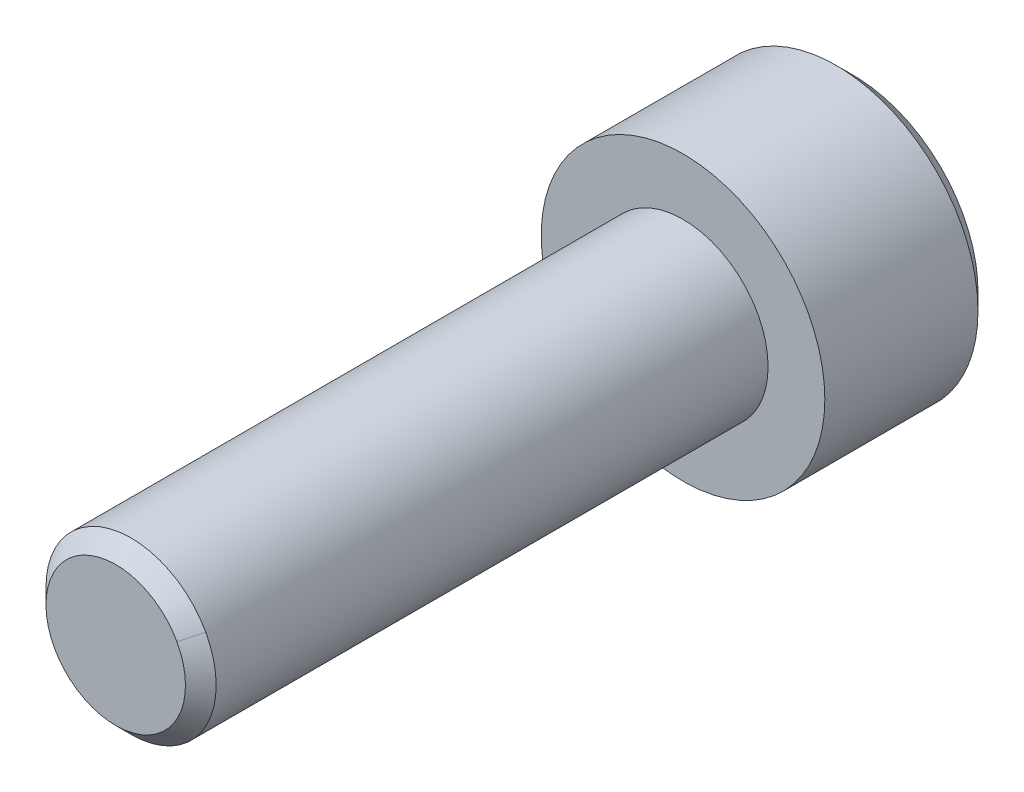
ISO-10303-21;
HEADER;
FILE_DESCRIPTION(('STEP AP214'),'2;1');
FILE_NAME('part.step','',(''),(''),'','','');
FILE_SCHEMA(('AUTOMOTIVE_DESIGN { 1 0 10303 214 1 1 1 1 }'));
ENDSEC;
DATA;
#1=APPLICATION_CONTEXT('core data for automotive mechanical design processes');
#2=APPLICATION_PROTOCOL_DEFINITION('international standard','automotive_design',2000,#1);
#3=PRODUCT_CONTEXT('',#1,'mechanical');
#4=PRODUCT('Part','Part','',(#3));
#5=PRODUCT_RELATED_PRODUCT_CATEGORY('part','',(#4));
#6=PRODUCT_DEFINITION_FORMATION('','',#4);
#7=PRODUCT_DEFINITION_CONTEXT('part definition',#1,'design');
#8=PRODUCT_DEFINITION('design','',#6,#7);
#9=PRODUCT_DEFINITION_SHAPE('','',#8);
#10=(LENGTH_UNIT() NAMED_UNIT(*) SI_UNIT(.MILLI.,.METRE.));
#11=(NAMED_UNIT(*) PLANE_ANGLE_UNIT() SI_UNIT($,.RADIAN.));
#12=(NAMED_UNIT(*) SI_UNIT($,.STERADIAN.) SOLID_ANGLE_UNIT());
#13=UNCERTAINTY_MEASURE_WITH_UNIT(LENGTH_MEASURE(1.E-05),#10,'distance_accuracy_value','');
#14=(GEOMETRIC_REPRESENTATION_CONTEXT(3) GLOBAL_UNCERTAINTY_ASSIGNED_CONTEXT((#13)) GLOBAL_UNIT_ASSIGNED_CONTEXT((#10,
#11,#12)) REPRESENTATION_CONTEXT('',''));
#15=CARTESIAN_POINT('',(0.,0.,0.));
#16=DIRECTION('',(0.,0.,1.));
#17=DIRECTION('',(1.,0.,0.));
#18=AXIS2_PLACEMENT_3D('',#15,#16,#17);
#19=CARTESIAN_POINT('',(0.,0.,3.));
#20=DIRECTION('',(0.,0.,-1.));
#21=DIRECTION('',(-1.,0.,0.));
#22=AXIS2_PLACEMENT_3D('',#19,#20,#21);
#23=PLANE('',#22);
#24=DIRECTION('',(0.50000000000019,-0.866025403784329,0.));
#25=VECTOR('',#24,1.);
#26=CARTESIAN_POINT('',(1.44337567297,2.5,3.));
#27=LINE('',#26,#25);
#28=CARTESIAN_POINT('',(2.88675134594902,-5.68989300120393E-13,3.));
#29=VERTEX_POINT('',#28);
#30=CARTESIAN_POINT('',(1.44337567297,2.5,3.));
#31=VERTEX_POINT('',#30);
#32=EDGE_CURVE('E98',#29,#31,#27,.F.);
#33=ORIENTED_EDGE('',*,*,#32,.F.);
#34=DIRECTION('',(-0.50000000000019,-0.866025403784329,0.));
#35=VECTOR('',#34,1.);
#36=CARTESIAN_POINT('',(2.88675134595,0.,3.));
#37=LINE('',#36,#35);
#38=CARTESIAN_POINT('',(1.44337567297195,-2.50000000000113,3.));
#39=VERTEX_POINT('',#38);
#40=EDGE_CURVE('E79',#39,#29,#37,.F.);
#41=ORIENTED_EDGE('',*,*,#40,.F.);
#42=DIRECTION('',(-1.,0.,0.));
#43=VECTOR('',#42,1.);
#44=CARTESIAN_POINT('',(1.44337567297,-2.50000000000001,3.));
#45=LINE('',#44,#43);
#46=CARTESIAN_POINT('',(-1.44337567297,-2.5,3.));
#47=VERTEX_POINT('',#46);
#48=EDGE_CURVE('E95',#47,#39,#45,.F.);
#49=ORIENTED_EDGE('',*,*,#48,.F.);
#50=DIRECTION('',(-0.50000000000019,0.866025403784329,0.));
#51=VECTOR('',#50,1.);
#52=CARTESIAN_POINT('',(-1.44337567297,-2.5,3.));
#53=LINE('',#52,#51);
#54=CARTESIAN_POINT('',(-2.88675134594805,1.11716191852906E-12,3.));
#55=VERTEX_POINT('',#54);
#56=EDGE_CURVE('E113',#55,#47,#53,.F.);
#57=ORIENTED_EDGE('',*,*,#56,.F.);
#58=DIRECTION('',(0.50000000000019,0.866025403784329,0.));
#59=VECTOR('',#58,1.);
#60=CARTESIAN_POINT('',(-2.88675134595,0.,3.));
#61=LINE('',#60,#59);
#62=CARTESIAN_POINT('',(-1.44337567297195,2.50000000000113,3.));
#63=VERTEX_POINT('',#62);
#64=EDGE_CURVE('E118',#63,#55,#61,.F.);
#65=ORIENTED_EDGE('',*,*,#64,.F.);
#66=DIRECTION('',(1.,0.,0.));
#67=VECTOR('',#66,1.);
#68=CARTESIAN_POINT('',(-1.44337567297,2.49999999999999,3.));
#69=LINE('',#68,#67);
#70=EDGE_CURVE('E124',#31,#63,#69,.F.);
#71=ORIENTED_EDGE('',*,*,#70,.F.);
#72=EDGE_LOOP('',(#33,#41,#49,#57,#65,#71));
#73=FACE_BOUND('',#72,.T.);
#74=ADVANCED_FACE('F16',(#73),#23,.T.);
#75=CARTESIAN_POINT('',(2.88675134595,0.,0.));
#76=DIRECTION('',(-0.866025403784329,0.50000000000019,0.));
#77=DIRECTION('',(-0.50000000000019,-0.866025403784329,0.));
#78=AXIS2_PLACEMENT_3D('',#75,#76,#77);
#79=PLANE('',#78);
#80=DIRECTION('',(0.,0.,1.));
#81=VECTOR('',#80,1.);
#82=CARTESIAN_POINT('',(1.44337567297,-2.50000000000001,0.));
#83=LINE('',#82,#81);
#84=CARTESIAN_POINT('',(1.44337567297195,-2.50000000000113,0.));
#85=VERTEX_POINT('',#84);
#86=EDGE_CURVE('E99',#39,#85,#83,.F.);
#87=ORIENTED_EDGE('',*,*,#86,.F.);
#88=ORIENTED_EDGE('',*,*,#40,.T.);
#89=DIRECTION('',(0.,0.,1.));
#90=VECTOR('',#89,1.);
#91=CARTESIAN_POINT('',(2.88675134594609,-2.26207941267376E-12,0.));
#92=LINE('',#91,#90);
#93=CARTESIAN_POINT('',(2.88675134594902,-5.68989300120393E-13,0.));
#94=VERTEX_POINT('',#93);
#95=EDGE_CURVE('E75',#94,#29,#92,.T.);
#96=ORIENTED_EDGE('',*,*,#95,.F.);
#97=DIRECTION('',(-0.500000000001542,-0.866025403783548,0.));
#98=VECTOR('',#97,1.);
#99=CARTESIAN_POINT('',(2.88675134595,0.,0.));
#100=LINE('',#99,#98);
#101=EDGE_CURVE('E104',#94,#85,#100,.T.);
#102=ORIENTED_EDGE('',*,*,#101,.T.);
#103=EDGE_LOOP('',(#87,#88,#96,#102));
#104=FACE_BOUND('',#103,.T.);
#105=ADVANCED_FACE('F102',(#104),#79,.T.);
#106=CARTESIAN_POINT('',(1.44337567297,-2.50000000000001,0.));
#107=DIRECTION('',(0.,1.,0.));
#108=DIRECTION('',(-1.,0.,0.));
#109=AXIS2_PLACEMENT_3D('',#106,#107,#108);
#110=PLANE('',#109);
#111=DIRECTION('',(0.,0.,1.));
#112=VECTOR('',#111,1.);
#113=CARTESIAN_POINT('',(-1.44337567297,-2.5,0.));
#114=LINE('',#113,#112);
#115=CARTESIAN_POINT('',(-1.44337567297,-2.5,0.));
#116=VERTEX_POINT('',#115);
#117=EDGE_CURVE('E110',#47,#116,#114,.F.);
#118=ORIENTED_EDGE('',*,*,#117,.F.);
#119=ORIENTED_EDGE('',*,*,#48,.T.);
#120=ORIENTED_EDGE('',*,*,#86,.T.);
#121=DIRECTION('',(1.,0.,0.));
#122=VECTOR('',#121,1.);
#123=CARTESIAN_POINT('',(0.,-2.50000000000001,0.));
#124=LINE('',#123,#122);
#125=EDGE_CURVE('E139',#85,#116,#124,.F.);
#126=ORIENTED_EDGE('',*,*,#125,.T.);
#127=EDGE_LOOP('',(#118,#119,#120,#126));
#128=FACE_BOUND('',#127,.T.);
#129=ADVANCED_FACE('F108',(#128),#110,.T.);
#130=CARTESIAN_POINT('',(-1.44337567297,-2.5,0.));
#131=DIRECTION('',(0.866025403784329,0.50000000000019,0.));
#132=DIRECTION('',(-0.50000000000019,0.866025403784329,0.));
#133=AXIS2_PLACEMENT_3D('',#130,#131,#132);
#134=PLANE('',#133);
#135=DIRECTION('',(0.,0.,1.));
#136=VECTOR('',#135,1.);
#137=CARTESIAN_POINT('',(-2.88675134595,0.,0.));
#138=LINE('',#137,#136);
#139=CARTESIAN_POINT('',(-2.88675134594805,1.11716191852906E-12,0.));
#140=VERTEX_POINT('',#139);
#141=EDGE_CURVE('E116',#55,#140,#138,.F.);
#142=ORIENTED_EDGE('',*,*,#141,.F.);
#143=ORIENTED_EDGE('',*,*,#56,.T.);
#144=ORIENTED_EDGE('',*,*,#117,.T.);
#145=DIRECTION('',(-0.500000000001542,0.866025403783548,0.));
#146=VECTOR('',#145,1.);
#147=CARTESIAN_POINT('',(-1.44337567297,-2.5,0.));
#148=LINE('',#147,#146);
#149=EDGE_CURVE('E137',#116,#140,#148,.T.);
#150=ORIENTED_EDGE('',*,*,#149,.T.);
#151=EDGE_LOOP('',(#142,#143,#144,#150));
#152=FACE_BOUND('',#151,.T.);
#153=ADVANCED_FACE('F263',(#152),#134,.T.);
#154=CARTESIAN_POINT('',(-2.88675134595,0.,0.));
#155=DIRECTION('',(0.866025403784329,-0.50000000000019,0.));
#156=DIRECTION('',(0.50000000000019,0.866025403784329,0.));
#157=AXIS2_PLACEMENT_3D('',#154,#155,#156);
#158=PLANE('',#157);
#159=DIRECTION('',(0.,0.,-1.));
#160=VECTOR('',#159,1.);
#161=CARTESIAN_POINT('',(-1.44337567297,2.49999999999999,0.));
#162=LINE('',#161,#160);
#163=CARTESIAN_POINT('',(-1.44337567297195,2.50000000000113,0.));
#164=VERTEX_POINT('',#163);
#165=EDGE_CURVE('E121',#63,#164,#162,.T.);
#166=ORIENTED_EDGE('',*,*,#165,.F.);
#167=ORIENTED_EDGE('',*,*,#64,.T.);
#168=ORIENTED_EDGE('',*,*,#141,.T.);
#169=DIRECTION('',(0.500000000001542,0.866025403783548,0.));
#170=VECTOR('',#169,1.);
#171=CARTESIAN_POINT('',(-2.88675134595,0.,0.));
#172=LINE('',#171,#170);
#173=EDGE_CURVE('E135',#140,#164,#172,.T.);
#174=ORIENTED_EDGE('',*,*,#173,.T.);
#175=EDGE_LOOP('',(#166,#167,#168,#174));
#176=FACE_BOUND('',#175,.T.);
#177=ADVANCED_FACE('F256',(#176),#158,.T.);
#178=CARTESIAN_POINT('',(-1.44337567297,2.49999999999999,0.));
#179=DIRECTION('',(0.,-1.,0.));
#180=DIRECTION('',(0.,0.,-1.));
#181=AXIS2_PLACEMENT_3D('',#178,#179,#180);
#182=PLANE('',#181);
#183=DIRECTION('',(0.,0.,1.));
#184=VECTOR('',#183,1.);
#185=CARTESIAN_POINT('',(1.44337567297,2.5,0.));
#186=LINE('',#185,#184);
#187=CARTESIAN_POINT('',(1.44337567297,2.5,0.));
#188=VERTEX_POINT('',#187);
#189=EDGE_CURVE('E127',#31,#188,#186,.F.);
#190=ORIENTED_EDGE('',*,*,#189,.F.);
#191=ORIENTED_EDGE('',*,*,#70,.T.);
#192=ORIENTED_EDGE('',*,*,#165,.T.);
#193=DIRECTION('',(1.,0.,0.));
#194=VECTOR('',#193,1.);
#195=CARTESIAN_POINT('',(0.,2.49999999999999,0.));
#196=LINE('',#195,#194);
#197=EDGE_CURVE('E55',#164,#188,#196,.T.);
#198=ORIENTED_EDGE('',*,*,#197,.T.);
#199=EDGE_LOOP('',(#190,#191,#192,#198));
#200=FACE_BOUND('',#199,.T.);
#201=ADVANCED_FACE('F184',(#200),#182,.T.);
#202=CARTESIAN_POINT('',(1.44337567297,2.5,0.));
#203=DIRECTION('',(-0.866025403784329,-0.50000000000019,0.));
#204=DIRECTION('',(0.50000000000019,-0.866025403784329,0.));
#205=AXIS2_PLACEMENT_3D('',#202,#203,#204);
#206=PLANE('',#205);
#207=ORIENTED_EDGE('',*,*,#95,.T.);
#208=ORIENTED_EDGE('',*,*,#32,.T.);
#209=ORIENTED_EDGE('',*,*,#189,.T.);
#210=DIRECTION('',(0.500000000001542,-0.866025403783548,0.));
#211=VECTOR('',#210,1.);
#212=CARTESIAN_POINT('',(1.44337567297,2.5,0.));
#213=LINE('',#212,#211);
#214=EDGE_CURVE('E132',#188,#94,#213,.T.);
#215=ORIENTED_EDGE('',*,*,#214,.T.);
#216=EDGE_LOOP('',(#207,#208,#209,#215));
#217=FACE_BOUND('',#216,.T.);
#218=ADVANCED_FACE('F174',(#217),#206,.T.);
#219=CARTESIAN_POINT('',(0.,0.,0.));
#220=DIRECTION('',(0.,0.,1.));
#221=DIRECTION('',(1.,0.,0.));
#222=AXIS2_PLACEMENT_3D('',#219,#220,#221);
#223=PLANE('',#222);
#224=ORIENTED_EDGE('',*,*,#197,.F.);
#225=ORIENTED_EDGE('',*,*,#173,.F.);
#226=ORIENTED_EDGE('',*,*,#149,.F.);
#227=ORIENTED_EDGE('',*,*,#125,.F.);
#228=ORIENTED_EDGE('',*,*,#101,.F.);
#229=ORIENTED_EDGE('',*,*,#214,.F.);
#230=EDGE_LOOP('',(#224,#225,#226,#227,#228,#229));
#231=FACE_BOUND('',#230,.T.);
#232=CARTESIAN_POINT('',(0.,0.,-2.4980018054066E-13));
#233=DIRECTION('',(0.,0.,1.));
#234=DIRECTION('',(0.,-1.,0.));
#235=AXIS2_PLACEMENT_3D('',#232,#233,#234);
#236=CIRCLE('',#235,4.39999999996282);
#237=CARTESIAN_POINT('',(0.,-4.39999999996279,-4.90820574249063E-13));
#238=VERTEX_POINT('',#237);
#239=EDGE_CURVE('E20',#238,#238,#236,.T.);
#240=ORIENTED_EDGE('',*,*,#239,.F.);
#241=EDGE_LOOP('',(#240));
#242=FACE_BOUND('',#241,.T.);
#243=ADVANCED_FACE('F172',(#231,#242),#223,.F.);
#244=CARTESIAN_POINT('',(0.,0.,0.599999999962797));
#245=DIRECTION('',(0.,0.,1.));
#246=DIRECTION('',(0.,-1.,0.));
#247=AXIS2_PLACEMENT_3D('',#244,#245,#246);
#248=CONICAL_SURFACE('',#247,4.99999999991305,0.785398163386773);
#249=ORIENTED_EDGE('',*,*,#239,.T.);
#250=EDGE_LOOP('',(#249));
#251=FACE_BOUND('',#250,.T.);
#252=CARTESIAN_POINT('',(0.,0.,0.599999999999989));
#253=DIRECTION('',(0.,0.,1.));
#254=DIRECTION('',(1.,0.,0.));
#255=AXIS2_PLACEMENT_3D('',#252,#253,#254);
#256=CIRCLE('',#255,5.);
#257=CARTESIAN_POINT('',(5.,0.,0.599999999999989));
#258=VERTEX_POINT('',#257);
#259=EDGE_CURVE('E158',#258,#258,#256,.T.);
#260=ORIENTED_EDGE('',*,*,#259,.F.);
#261=EDGE_LOOP('',(#260));
#262=FACE_BOUND('',#261,.T.);
#263=ADVANCED_FACE('F169',(#251,#262),#248,.T.);
#264=CARTESIAN_POINT('',(2.4585,0.,26.));
#265=DIRECTION('',(0.,0.,1.));
#266=DIRECTION('',(1.,0.,0.));
#267=AXIS2_PLACEMENT_3D('',#264,#265,#266);
#268=PLANE('',#267);
#269=CARTESIAN_POINT('',(0.,0.,25.9999999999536));
#270=DIRECTION('',(0.,0.,-1.));
#271=DIRECTION('',(0.,1.,0.));
#272=AXIS2_PLACEMENT_3D('',#269,#270,#271);
#273=CIRCLE('',#272,2.45850000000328);
#274=CARTESIAN_POINT('',(2.15753672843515,1.17866768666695,25.9999999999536));
#275=VERTEX_POINT('',#274);
#276=CARTESIAN_POINT('',(-2.15753672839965,-1.17866768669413,25.9999999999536));
#277=VERTEX_POINT('',#276);
#278=EDGE_CURVE('E152',#275,#277,#273,.T.);
#279=ORIENTED_EDGE('',*,*,#278,.F.);
#280=CARTESIAN_POINT('',(0.,0.,25.9999999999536));
#281=DIRECTION('',(0.,0.,-1.));
#282=DIRECTION('',(0.,1.,0.));
#283=AXIS2_PLACEMENT_3D('',#280,#281,#282);
#284=CIRCLE('',#283,2.45850000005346);
#285=EDGE_CURVE('E46',#277,#275,#284,.T.);
#286=ORIENTED_EDGE('',*,*,#285,.F.);
#287=EDGE_LOOP('',(#279,#286));
#288=FACE_BOUND('',#287,.T.);
#289=ADVANCED_FACE('F182',(#288),#268,.T.);
#290=CARTESIAN_POINT('',(0.,0.,25.4584999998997));
#291=DIRECTION('',(0.,0.,-1.));
#292=DIRECTION('',(0.,1.,0.));
#293=AXIS2_PLACEMENT_3D('',#290,#291,#292);
#294=CONICAL_SURFACE('',#293,3.00000000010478,0.785398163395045);
#295=DIRECTION('',(-0.620544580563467,-0.339005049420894,0.707106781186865));
#296=VECTOR('',#295,1.);
#297=CARTESIAN_POINT('',(437938.67306624,239246.987494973,-499000.));
#298=LINE('',#297,#296);
#299=CARTESIAN_POINT('',(2.63274768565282,1.43827661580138,25.4585000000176));
#300=VERTEX_POINT('',#299);
#301=EDGE_CURVE('E155',#300,#275,#298,.T.);
#302=ORIENTED_EDGE('',*,*,#301,.F.);
#303=CARTESIAN_POINT('',(0.,0.,25.4585));
#304=DIRECTION('',(0.,0.,1.));
#305=DIRECTION('',(1.,0.,0.));
#306=AXIS2_PLACEMENT_3D('',#303,#304,#305);
#307=CIRCLE('',#306,3.);
#308=CARTESIAN_POINT('',(-2.63274768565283,-1.4382766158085,25.4585000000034));
#309=VERTEX_POINT('',#308);
#310=EDGE_CURVE('E35',#309,#300,#307,.F.);
#311=ORIENTED_EDGE('',*,*,#310,.F.);
#312=DIRECTION('',(0.620544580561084,0.339005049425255,0.707106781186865));
#313=VECTOR('',#312,1.);
#314=CARTESIAN_POINT('',(-437938.673064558,-239246.987498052,-499000.));
#315=LINE('',#314,#313);
#316=EDGE_CURVE('E144',#277,#309,#315,.F.);
#317=ORIENTED_EDGE('',*,*,#316,.F.);
#318=ORIENTED_EDGE('',*,*,#285,.T.);
#319=EDGE_LOOP('',(#302,#311,#317,#318));
#320=FACE_BOUND('',#319,.T.);
#321=ADVANCED_FACE('F204',(#320),#294,.T.);
#322=CARTESIAN_POINT('',(0.,0.,13.));
#323=DIRECTION('',(0.,0.,1.));
#324=DIRECTION('',(1.,0.,0.));
#325=AXIS2_PLACEMENT_3D('',#322,#323,#324);
#326=CYLINDRICAL_SURFACE('',#325,5.);
#327=CARTESIAN_POINT('',(0.,0.,6.00000000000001));
#328=DIRECTION('',(0.,0.,1.));
#329=DIRECTION('',(1.,0.,0.));
#330=AXIS2_PLACEMENT_3D('',#327,#328,#329);
#331=CIRCLE('',#330,5.);
#332=CARTESIAN_POINT('',(5.,0.,6.));
#333=VERTEX_POINT('',#332);
#334=EDGE_CURVE('E143',#333,#333,#331,.T.);
#335=ORIENTED_EDGE('',*,*,#334,.F.);
#336=EDGE_LOOP('',(#335));
#337=FACE_BOUND('',#336,.T.);
#338=ORIENTED_EDGE('',*,*,#259,.T.);
#339=EDGE_LOOP('',(#338));
#340=FACE_BOUND('',#339,.T.);
#341=ADVANCED_FACE('F201',(#337,#340),#326,.T.);
#342=CARTESIAN_POINT('',(0.,0.,25.4584999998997));
#343=DIRECTION('',(0.,0.,-1.));
#344=DIRECTION('',(0.,1.,0.));
#345=AXIS2_PLACEMENT_3D('',#342,#343,#344);
#346=CONICAL_SURFACE('',#345,3.00000000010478,0.785398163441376);
#347=ORIENTED_EDGE('',*,*,#316,.T.);
#348=CARTESIAN_POINT('',(0.,0.,25.4585));
#349=DIRECTION('',(0.,0.,1.));
#350=DIRECTION('',(1.,0.,0.));
#351=AXIS2_PLACEMENT_3D('',#348,#349,#350);
#352=CIRCLE('',#351,3.);
#353=EDGE_CURVE('E26',#300,#309,#352,.F.);
#354=ORIENTED_EDGE('',*,*,#353,.F.);
#355=ORIENTED_EDGE('',*,*,#301,.T.);
#356=ORIENTED_EDGE('',*,*,#278,.T.);
#357=EDGE_LOOP('',(#347,#354,#355,#356));
#358=FACE_BOUND('',#357,.T.);
#359=ADVANCED_FACE('F193',(#358),#346,.T.);
#360=CARTESIAN_POINT('',(5.,0.,6.00000000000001));
#361=DIRECTION('',(0.,0.,1.));
#362=DIRECTION('',(1.,0.,0.));
#363=AXIS2_PLACEMENT_3D('',#360,#361,#362);
#364=PLANE('',#363);
#365=CARTESIAN_POINT('',(0.,0.,6.00000000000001));
#366=DIRECTION('',(0.,0.,1.));
#367=DIRECTION('',(1.,0.,0.));
#368=AXIS2_PLACEMENT_3D('',#365,#366,#367);
#369=CIRCLE('',#368,3.);
#370=CARTESIAN_POINT('',(3.,0.,6.00000000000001));
#371=VERTEX_POINT('',#370);
#372=EDGE_CURVE('E11',#371,#371,#369,.T.);
#373=ORIENTED_EDGE('',*,*,#372,.F.);
#374=EDGE_LOOP('',(#373));
#375=FACE_BOUND('',#374,.T.);
#376=ORIENTED_EDGE('',*,*,#334,.T.);
#377=EDGE_LOOP('',(#376));
#378=FACE_BOUND('',#377,.T.);
#379=ADVANCED_FACE('F188',(#375,#378),#364,.T.);
#380=CARTESIAN_POINT('',(0.,0.,13.));
#381=DIRECTION('',(0.,0.,1.));
#382=DIRECTION('',(1.,0.,0.));
#383=AXIS2_PLACEMENT_3D('',#380,#381,#382);
#384=CYLINDRICAL_SURFACE('',#383,3.);
#385=ORIENTED_EDGE('',*,*,#310,.T.);
#386=ORIENTED_EDGE('',*,*,#353,.T.);
#387=EDGE_LOOP('',(#385,#386));
#388=FACE_BOUND('',#387,.T.);
#389=ORIENTED_EDGE('',*,*,#372,.T.);
#390=EDGE_LOOP('',(#389));
#391=FACE_BOUND('',#390,.T.);
#392=ADVANCED_FACE('F18',(#388,#391),#384,.T.);
#393=CLOSED_SHELL('',(#74,#105,#129,#153,#177,#201,#218,#243,#263,#289,#321,#341,#359,#379,#392));
#394=MANIFOLD_SOLID_BREP('B1',#393);
#395=ADVANCED_BREP_SHAPE_REPRESENTATION('',(#18,#394),#14);
#396=SHAPE_DEFINITION_REPRESENTATION(#9,#395);
ENDSEC;
END-ISO-10303-21;
